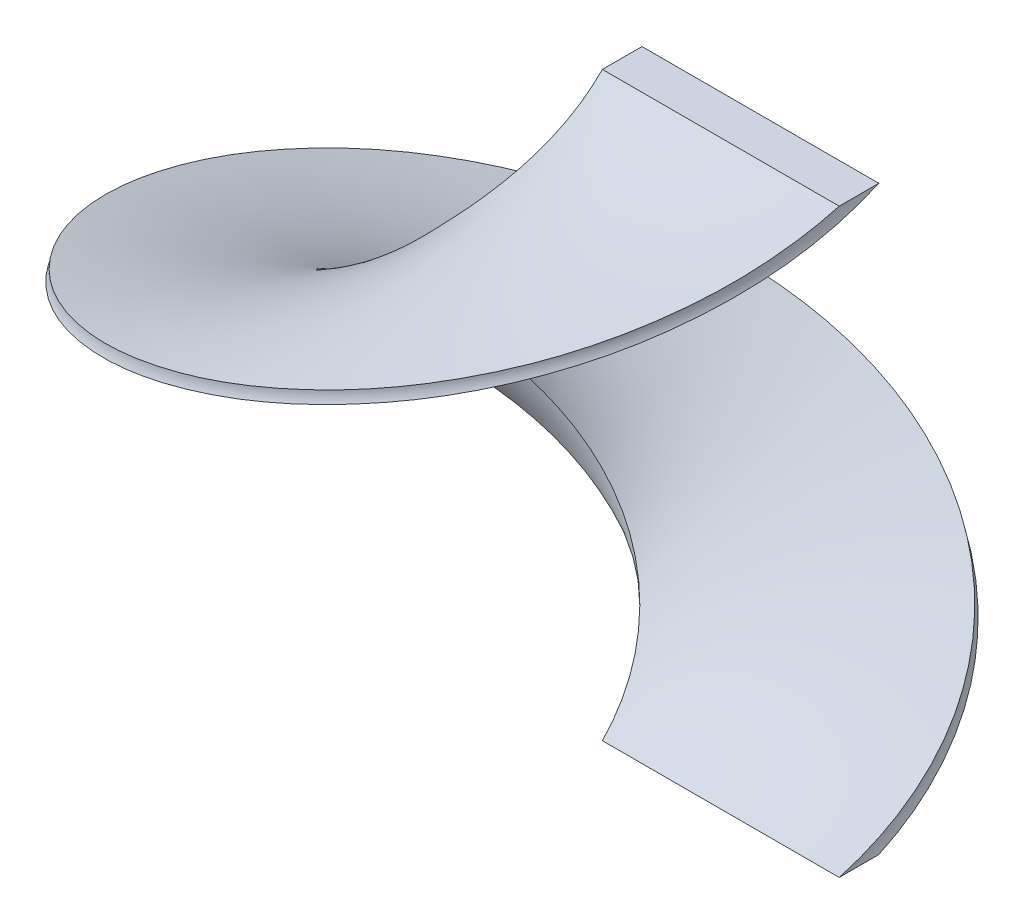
ISO-10303-21;
HEADER;
FILE_DESCRIPTION(('STEP AP214'),'2;1');
FILE_NAME('part.step','',(''),(''),'','','');
FILE_SCHEMA(('AUTOMOTIVE_DESIGN { 1 0 10303 214 1 1 1 1 }'));
ENDSEC;
DATA;
#1=APPLICATION_CONTEXT('core data for automotive mechanical design processes');
#2=APPLICATION_PROTOCOL_DEFINITION('international standard','automotive_design',2000,#1);
#3=PRODUCT_CONTEXT('',#1,'mechanical');
#4=PRODUCT('Part','Part','',(#3));
#5=PRODUCT_RELATED_PRODUCT_CATEGORY('part','',(#4));
#6=PRODUCT_DEFINITION_FORMATION('','',#4);
#7=PRODUCT_DEFINITION_CONTEXT('part definition',#1,'design');
#8=PRODUCT_DEFINITION('design','',#6,#7);
#9=PRODUCT_DEFINITION_SHAPE('','',#8);
#10=(LENGTH_UNIT() NAMED_UNIT(*) SI_UNIT(.MILLI.,.METRE.));
#11=(NAMED_UNIT(*) PLANE_ANGLE_UNIT() SI_UNIT($,.RADIAN.));
#12=(NAMED_UNIT(*) SI_UNIT($,.STERADIAN.) SOLID_ANGLE_UNIT());
#13=UNCERTAINTY_MEASURE_WITH_UNIT(LENGTH_MEASURE(1.E-05),#10,'distance_accuracy_value','');
#14=(GEOMETRIC_REPRESENTATION_CONTEXT(3) GLOBAL_UNCERTAINTY_ASSIGNED_CONTEXT((#13)) GLOBAL_UNIT_ASSIGNED_CONTEXT((#10,
#11,#12)) REPRESENTATION_CONTEXT('',''));
#15=CARTESIAN_POINT('',(0.,0.,0.));
#16=DIRECTION('',(0.,0.,1.));
#17=DIRECTION('',(1.,0.,0.));
#18=AXIS2_PLACEMENT_3D('',#15,#16,#17);
#19=CARTESIAN_POINT('',(0.,0.,0.));
#20=DIRECTION('',(0.,1.,0.));
#21=DIRECTION('',(0.,0.,1.));
#22=AXIS2_PLACEMENT_3D('',#19,#20,#21);
#23=PLANE('',#22);
#24=DIRECTION('',(0.,0.,1.));
#25=VECTOR('',#24,1.);
#26=CARTESIAN_POINT('',(13.335,0.,-5.842));
#27=LINE('',#26,#25);
#28=CARTESIAN_POINT('',(13.335,0.,-5.842));
#29=VERTEX_POINT('',#28);
#30=CARTESIAN_POINT('',(13.335,0.,0.));
#31=VERTEX_POINT('',#30);
#32=EDGE_CURVE('E74',#29,#31,#27,.T.);
#33=ORIENTED_EDGE('',*,*,#32,.F.);
#34=DIRECTION('',(-1.,0.,0.));
#35=VECTOR('',#34,1.);
#36=CARTESIAN_POINT('',(13.335,0.,-5.842));
#37=LINE('',#36,#35);
#38=CARTESIAN_POINT('',(48.26,0.,-5.842));
#39=VERTEX_POINT('',#38);
#40=EDGE_CURVE('E62',#39,#29,#37,.T.);
#41=ORIENTED_EDGE('',*,*,#40,.F.);
#42=DIRECTION('',(0.,0.,-1.));
#43=VECTOR('',#42,1.);
#44=CARTESIAN_POINT('',(48.26,0.,-5.842));
#45=LINE('',#44,#43);
#46=CARTESIAN_POINT('',(48.26,0.,0.));
#47=VERTEX_POINT('',#46);
#48=EDGE_CURVE('E67',#47,#39,#45,.T.);
#49=ORIENTED_EDGE('',*,*,#48,.F.);
#50=DIRECTION('',(1.,0.,0.));
#51=VECTOR('',#50,1.);
#52=CARTESIAN_POINT('',(13.335,0.,0.));
#53=LINE('',#52,#51);
#54=EDGE_CURVE('E71',#31,#47,#53,.T.);
#55=ORIENTED_EDGE('',*,*,#54,.F.);
#56=EDGE_LOOP('',(#33,#41,#49,#55));
#57=FACE_BOUND('',#56,.T.);
#58=ADVANCED_FACE('F32',(#57),#23,.F.);
#59=CARTESIAN_POINT('',(0.,85.725,0.));
#60=DIRECTION('',(0.,1.,0.));
#61=DIRECTION('',(0.,0.,1.));
#62=AXIS2_PLACEMENT_3D('',#59,#60,#61);
#63=PLANE('',#62);
#64=DIRECTION('',(0.,0.,1.));
#65=VECTOR('',#64,1.);
#66=CARTESIAN_POINT('',(13.3349999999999,85.725,-5.84200000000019));
#67=LINE('',#66,#65);
#68=CARTESIAN_POINT('',(13.335,85.7249999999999,-5.84200000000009));
#69=VERTEX_POINT('',#68);
#70=CARTESIAN_POINT('',(13.335,85.7249999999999,0.));
#71=VERTEX_POINT('',#70);
#72=EDGE_CURVE('E88',#69,#71,#67,.T.);
#73=ORIENTED_EDGE('',*,*,#72,.T.);
#74=DIRECTION('',(1.,0.,0.));
#75=VECTOR('',#74,1.);
#76=CARTESIAN_POINT('',(13.335,85.725,-1.86235614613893E-13));
#77=LINE('',#76,#75);
#78=CARTESIAN_POINT('',(48.26,85.7249999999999,-3.31087633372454E-13));
#79=VERTEX_POINT('',#78);
#80=EDGE_CURVE('E51',#71,#79,#77,.T.);
#81=ORIENTED_EDGE('',*,*,#80,.T.);
#82=DIRECTION('',(0.,0.,-1.));
#83=VECTOR('',#82,1.);
#84=CARTESIAN_POINT('',(48.2599999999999,85.725,-5.84200000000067));
#85=LINE('',#84,#83);
#86=CARTESIAN_POINT('',(48.26,85.7249999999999,-5.84200000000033));
#87=VERTEX_POINT('',#86);
#88=EDGE_CURVE('E45',#79,#87,#85,.T.);
#89=ORIENTED_EDGE('',*,*,#88,.T.);
#90=DIRECTION('',(-1.,0.,0.));
#91=VECTOR('',#90,1.);
#92=CARTESIAN_POINT('',(13.3349999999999,85.725,-5.84200000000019));
#93=LINE('',#92,#91);
#94=EDGE_CURVE('E11',#87,#69,#93,.T.);
#95=ORIENTED_EDGE('',*,*,#94,.T.);
#96=EDGE_LOOP('',(#73,#81,#89,#95));
#97=FACE_BOUND('',#96,.T.);
#98=ADVANCED_FACE('F133',(#97),#63,.T.);
#99=CARTESIAN_POINT('',(13.335,0.,-5.842));
#100=CARTESIAN_POINT('',(12.172953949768,2.67890624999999,-8.49449641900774));
#101=CARTESIAN_POINT('',(10.0842969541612,5.35781249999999,-10.5003877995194));
#102=CARTESIAN_POINT('',(7.99563995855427,8.03671874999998,-12.5062791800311));
#103=CARTESIAN_POINT('',(5.2983511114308,10.715625,-13.5601867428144));
#104=CARTESIAN_POINT('',(2.60106226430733,13.39453125,-14.6140943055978));
#105=CARTESIAN_POINT('',(-0.294220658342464,16.0734375,-14.5555701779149));
#106=CARTESIAN_POINT('',(-3.18950358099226,18.75234375,-14.497046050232));
#107=CARTESIAN_POINT('',(-5.842,21.4312499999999,-13.335));
#108=CARTESIAN_POINT('',(-8.49449641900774,24.1101562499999,-12.172953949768));
#109=CARTESIAN_POINT('',(-10.5003877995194,26.7890624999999,-10.0842969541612));
#110=CARTESIAN_POINT('',(-12.5062791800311,29.4679687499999,-7.99563995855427));
#111=CARTESIAN_POINT('',(-13.5601867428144,32.1468749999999,-5.2983511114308));
#112=CARTESIAN_POINT('',(-14.6140943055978,34.8257812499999,-2.60106226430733));
#113=CARTESIAN_POINT('',(-14.5555701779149,37.5046874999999,0.294220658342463));
#114=CARTESIAN_POINT('',(-14.497046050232,40.1835937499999,3.18950358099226));
#115=CARTESIAN_POINT('',(-13.335,42.8624999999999,5.842));
#116=CARTESIAN_POINT('',(-12.172953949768,45.5414062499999,8.49449641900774));
#117=CARTESIAN_POINT('',(-10.0842969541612,48.2203124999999,10.5003877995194));
#118=CARTESIAN_POINT('',(-7.99563995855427,50.8992187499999,12.5062791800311));
#119=CARTESIAN_POINT('',(-5.2983511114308,53.5781249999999,13.5601867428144));
#120=CARTESIAN_POINT('',(-2.60106226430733,56.2570312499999,14.6140943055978));
#121=CARTESIAN_POINT('',(0.294220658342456,58.9359374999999,14.5555701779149));
#122=CARTESIAN_POINT('',(3.18950358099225,61.6148437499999,14.497046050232));
#123=CARTESIAN_POINT('',(5.842,64.2937499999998,13.335));
#124=CARTESIAN_POINT('',(8.49449641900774,66.9726562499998,12.172953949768));
#125=CARTESIAN_POINT('',(10.5003877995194,69.6515624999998,10.0842969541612));
#126=CARTESIAN_POINT('',(12.5062791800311,72.3304687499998,7.99563995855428));
#127=CARTESIAN_POINT('',(13.5601867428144,75.0093749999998,5.2983511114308));
#128=CARTESIAN_POINT('',(14.6140943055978,77.6882812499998,2.60106226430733));
#129=CARTESIAN_POINT('',(14.5555701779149,80.3671874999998,-0.294220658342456));
#130=CARTESIAN_POINT('',(14.497046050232,83.0460937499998,-3.18950358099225));
#131=CARTESIAN_POINT('',(13.335,85.7249999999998,-5.842));
#132=CARTESIAN_POINT('',(13.335,0.,0.));
#133=CARTESIAN_POINT('',(13.335,2.67890624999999,-2.65249641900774));
#134=CARTESIAN_POINT('',(12.319933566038,5.35781249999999,-5.10308357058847));
#135=CARTESIAN_POINT('',(11.304867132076,8.03671874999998,-7.5536707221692));
#136=CARTESIAN_POINT('',(9.42926892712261,10.715625,-9.42926892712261));
#137=CARTESIAN_POINT('',(7.5536707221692,13.39453125,-11.304867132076));
#138=CARTESIAN_POINT('',(5.10308357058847,16.0734375,-12.319933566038));
#139=CARTESIAN_POINT('',(2.65249641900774,18.75234375,-13.335));
#140=CARTESIAN_POINT('',(0.,21.4312499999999,-13.335));
#141=CARTESIAN_POINT('',(-2.65249641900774,24.1101562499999,-13.335));
#142=CARTESIAN_POINT('',(-5.10308357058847,26.7890624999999,-12.319933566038));
#143=CARTESIAN_POINT('',(-7.5536707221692,29.4679687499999,-11.304867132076));
#144=CARTESIAN_POINT('',(-9.42926892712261,32.1468749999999,-9.42926892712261));
#145=CARTESIAN_POINT('',(-11.304867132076,34.8257812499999,-7.5536707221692));
#146=CARTESIAN_POINT('',(-12.319933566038,37.5046874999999,-5.10308357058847));
#147=CARTESIAN_POINT('',(-13.335,40.1835937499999,-2.65249641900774));
#148=CARTESIAN_POINT('',(-13.335,42.8624999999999,0.));
#149=CARTESIAN_POINT('',(-13.335,45.5414062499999,2.65249641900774));
#150=CARTESIAN_POINT('',(-12.319933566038,48.2203124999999,5.10308357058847));
#151=CARTESIAN_POINT('',(-11.304867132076,50.8992187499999,7.5536707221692));
#152=CARTESIAN_POINT('',(-9.42926892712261,53.5781249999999,9.42926892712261));
#153=CARTESIAN_POINT('',(-7.5536707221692,56.2570312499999,11.304867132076));
#154=CARTESIAN_POINT('',(-5.10308357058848,58.9359374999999,12.319933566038));
#155=CARTESIAN_POINT('',(-2.65249641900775,61.6148437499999,13.335));
#156=CARTESIAN_POINT('',(0.,64.2937499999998,13.335));
#157=CARTESIAN_POINT('',(2.65249641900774,66.9726562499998,13.335));
#158=CARTESIAN_POINT('',(5.10308357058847,69.6515624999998,12.319933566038));
#159=CARTESIAN_POINT('',(7.5536707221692,72.3304687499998,11.304867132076));
#160=CARTESIAN_POINT('',(9.42926892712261,75.0093749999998,9.42926892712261));
#161=CARTESIAN_POINT('',(11.304867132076,77.6882812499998,7.5536707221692));
#162=CARTESIAN_POINT('',(12.319933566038,80.3671874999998,5.10308357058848));
#163=CARTESIAN_POINT('',(13.335,83.0460937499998,2.65249641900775));
#164=CARTESIAN_POINT('',(13.335,85.7249999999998,0.));
#165=(BOUNDED_SURFACE() B_SPLINE_SURFACE(1,2,((#99,#100,#101,#102,#103,#104,#105,#106,#107,#108,
#109,#110,#111,#112,#113,#114,#115,#116,#117,#118,#119,#120,#121,#122,#123,#124,#125,#126,#127,
#128,#129,#130,#131),(#132,#133,#134,#135,#136,#137,#138,#139,#140,#141,#142,#143,#144,#145,
#146,#147,#148,#149,#150,#151,#152,#153,#154,#155,#156,#157,#158,#159,#160,#161,#162,#163,
#164)),.UNSPECIFIED.,.F.,.F.,.F.) B_SPLINE_SURFACE_WITH_KNOTS((2,2),(3,2,2,2,2,2,2,2,2,2,2,2,2,
2,2,2,3),(0.,1.),(0.,0.0625,0.125,0.1875,0.25,0.3125,0.375,0.4375,0.5,0.5625,0.625,0.6875,0.75,
0.8125,0.875,0.9375,1.),
.UNSPECIFIED.) GEOMETRIC_REPRESENTATION_ITEM() RATIONAL_B_SPLINE_SURFACE(((1.,0.98078528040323,
1.,0.98078528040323,1.,0.98078528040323,1.,0.98078528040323,1.,0.98078528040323,1.,
0.98078528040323,1.,0.98078528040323,1.,0.98078528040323,1.,0.98078528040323,1.,
0.98078528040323,1.,0.98078528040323,1.,0.98078528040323,1.,0.98078528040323,1.,
0.98078528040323,1.,0.98078528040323,1.,0.98078528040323,1.),(1.,0.98078528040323,1.,
0.98078528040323,1.,0.98078528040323,1.,0.98078528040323,1.,0.98078528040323,1.,
0.98078528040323,1.,0.98078528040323,1.,0.98078528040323,1.,0.98078528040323,1.,
0.98078528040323,1.,0.98078528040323,1.,0.98078528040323,1.,0.98078528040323,1.,
0.98078528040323,1.,0.98078528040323,1.,0.98078528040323,1.))) REPRESENTATION_ITEM('') SURFACE());
#166=CARTESIAN_POINT('',(13.335,0.,0.));
#167=CARTESIAN_POINT('',(13.335,2.67890624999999,-2.65249641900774));
#168=CARTESIAN_POINT('',(12.319933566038,5.35781249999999,-5.10308357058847));
#169=CARTESIAN_POINT('',(11.304867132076,8.03671874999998,-7.5536707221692));
#170=CARTESIAN_POINT('',(9.42926892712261,10.715625,-9.42926892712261));
#171=CARTESIAN_POINT('',(7.5536707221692,13.39453125,-11.304867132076));
#172=CARTESIAN_POINT('',(5.10308357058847,16.0734375,-12.319933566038));
#173=CARTESIAN_POINT('',(2.65249641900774,18.75234375,-13.335));
#174=CARTESIAN_POINT('',(0.,21.4312499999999,-13.335));
#175=CARTESIAN_POINT('',(-2.65249641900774,24.1101562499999,-13.335));
#176=CARTESIAN_POINT('',(-5.10308357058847,26.7890624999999,-12.319933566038));
#177=CARTESIAN_POINT('',(-7.5536707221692,29.4679687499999,-11.304867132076));
#178=CARTESIAN_POINT('',(-9.42926892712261,32.1468749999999,-9.42926892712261));
#179=CARTESIAN_POINT('',(-11.304867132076,34.8257812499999,-7.5536707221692));
#180=CARTESIAN_POINT('',(-12.319933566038,37.5046874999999,-5.10308357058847));
#181=CARTESIAN_POINT('',(-13.335,40.1835937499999,-2.65249641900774));
#182=CARTESIAN_POINT('',(-13.335,42.8624999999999,0.));
#183=CARTESIAN_POINT('',(-13.335,45.5414062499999,2.65249641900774));
#184=CARTESIAN_POINT('',(-12.319933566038,48.2203124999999,5.10308357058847));
#185=CARTESIAN_POINT('',(-11.304867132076,50.8992187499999,7.5536707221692));
#186=CARTESIAN_POINT('',(-9.42926892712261,53.5781249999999,9.42926892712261));
#187=CARTESIAN_POINT('',(-7.5536707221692,56.2570312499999,11.304867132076));
#188=CARTESIAN_POINT('',(-5.10308357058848,58.9359374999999,12.319933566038));
#189=CARTESIAN_POINT('',(-2.65249641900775,61.6148437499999,13.335));
#190=CARTESIAN_POINT('',(0.,64.2937499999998,13.335));
#191=CARTESIAN_POINT('',(2.65249641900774,66.9726562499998,13.335));
#192=CARTESIAN_POINT('',(5.10308357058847,69.6515624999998,12.319933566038));
#193=CARTESIAN_POINT('',(7.5536707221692,72.3304687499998,11.304867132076));
#194=CARTESIAN_POINT('',(9.42926892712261,75.0093749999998,9.42926892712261));
#195=CARTESIAN_POINT('',(11.304867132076,77.6882812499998,7.5536707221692));
#196=CARTESIAN_POINT('',(12.319933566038,80.3671874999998,5.10308357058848));
#197=CARTESIAN_POINT('',(13.335,83.0460937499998,2.65249641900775));
#198=CARTESIAN_POINT('',(13.335,85.7249999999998,0.));
#199=(BOUNDED_CURVE() B_SPLINE_CURVE(2,(#166,#167,#168,#169,#170,#171,#172,#173,#174,#175,#176,
#177,#178,#179,#180,#181,#182,#183,#184,#185,#186,#187,#188,#189,#190,#191,#192,#193,#194,#195,
#196,#197,#198),.UNSPECIFIED.,.F.,.F.) B_SPLINE_CURVE_WITH_KNOTS((3,2,2,2,2,2,2,2,2,2,2,2,2,2,2,
2,3),(0.,0.0625,0.125,0.1875,0.25,0.3125,0.375,0.4375,0.5,0.5625,0.625,0.6875,0.75,0.8125,0.875,
0.9375,1.),.UNSPECIFIED.) CURVE() GEOMETRIC_REPRESENTATION_ITEM() RATIONAL_B_SPLINE_CURVE((1.,
0.98078528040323,1.,0.98078528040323,1.,0.98078528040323,1.,0.98078528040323,1.,
0.98078528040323,1.,0.98078528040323,1.,0.98078528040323,1.,0.98078528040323,1.,
0.98078528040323,1.,0.98078528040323,1.,0.98078528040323,1.,0.98078528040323,1.,
0.98078528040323,1.,0.98078528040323,1.,0.98078528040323,1.,0.98078528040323,1.)) REPRESENTATION_ITEM(''));
#200=EDGE_CURVE('E90',#31,#71,#199,.T.);
#201=CARTESIAN_POINT('',(13.335,0.,-5.842));
#202=CARTESIAN_POINT('',(12.172953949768,2.67890624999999,-8.49449641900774));
#203=CARTESIAN_POINT('',(10.0842969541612,5.35781249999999,-10.5003877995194));
#204=CARTESIAN_POINT('',(7.99563995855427,8.03671874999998,-12.5062791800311));
#205=CARTESIAN_POINT('',(5.2983511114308,10.715625,-13.5601867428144));
#206=CARTESIAN_POINT('',(2.60106226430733,13.39453125,-14.6140943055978));
#207=CARTESIAN_POINT('',(-0.294220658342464,16.0734375,-14.5555701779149));
#208=CARTESIAN_POINT('',(-3.18950358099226,18.75234375,-14.497046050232));
#209=CARTESIAN_POINT('',(-5.842,21.4312499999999,-13.335));
#210=CARTESIAN_POINT('',(-8.49449641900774,24.1101562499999,-12.172953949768));
#211=CARTESIAN_POINT('',(-10.5003877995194,26.7890624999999,-10.0842969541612));
#212=CARTESIAN_POINT('',(-12.5062791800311,29.4679687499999,-7.99563995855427));
#213=CARTESIAN_POINT('',(-13.5601867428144,32.1468749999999,-5.2983511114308));
#214=CARTESIAN_POINT('',(-14.6140943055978,34.8257812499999,-2.60106226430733));
#215=CARTESIAN_POINT('',(-14.5555701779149,37.5046874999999,0.294220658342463));
#216=CARTESIAN_POINT('',(-14.497046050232,40.1835937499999,3.18950358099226));
#217=CARTESIAN_POINT('',(-13.335,42.8624999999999,5.842));
#218=CARTESIAN_POINT('',(-12.172953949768,45.5414062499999,8.49449641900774));
#219=CARTESIAN_POINT('',(-10.0842969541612,48.2203124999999,10.5003877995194));
#220=CARTESIAN_POINT('',(-7.99563995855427,50.8992187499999,12.5062791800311));
#221=CARTESIAN_POINT('',(-5.2983511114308,53.5781249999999,13.5601867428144));
#222=CARTESIAN_POINT('',(-2.60106226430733,56.2570312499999,14.6140943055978));
#223=CARTESIAN_POINT('',(0.294220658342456,58.9359374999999,14.5555701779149));
#224=CARTESIAN_POINT('',(3.18950358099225,61.6148437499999,14.497046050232));
#225=CARTESIAN_POINT('',(5.842,64.2937499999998,13.335));
#226=CARTESIAN_POINT('',(8.49449641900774,66.9726562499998,12.172953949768));
#227=CARTESIAN_POINT('',(10.5003877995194,69.6515624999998,10.0842969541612));
#228=CARTESIAN_POINT('',(12.5062791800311,72.3304687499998,7.99563995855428));
#229=CARTESIAN_POINT('',(13.5601867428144,75.0093749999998,5.2983511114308));
#230=CARTESIAN_POINT('',(14.6140943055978,77.6882812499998,2.60106226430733));
#231=CARTESIAN_POINT('',(14.5555701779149,80.3671874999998,-0.294220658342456));
#232=CARTESIAN_POINT('',(14.497046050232,83.0460937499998,-3.18950358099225));
#233=CARTESIAN_POINT('',(13.335,85.7249999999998,-5.842));
#234=(BOUNDED_CURVE() B_SPLINE_CURVE(2,(#201,#202,#203,#204,#205,#206,#207,#208,#209,#210,#211,
#212,#213,#214,#215,#216,#217,#218,#219,#220,#221,#222,#223,#224,#225,#226,#227,#228,#229,#230,
#231,#232,#233),.UNSPECIFIED.,.F.,.F.) B_SPLINE_CURVE_WITH_KNOTS((3,2,2,2,2,2,2,2,2,2,2,2,2,2,2,
2,3),(0.,0.0625,0.125,0.1875,0.25,0.3125,0.375,0.4375,0.5,0.5625,0.625,0.6875,0.75,0.8125,0.875,
0.9375,1.),.UNSPECIFIED.) CURVE() GEOMETRIC_REPRESENTATION_ITEM() RATIONAL_B_SPLINE_CURVE((1.,
0.98078528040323,1.,0.98078528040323,1.,0.98078528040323,1.,0.98078528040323,1.,
0.98078528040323,1.,0.98078528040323,1.,0.98078528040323,1.,0.98078528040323,1.,
0.98078528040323,1.,0.98078528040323,1.,0.98078528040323,1.,0.98078528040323,1.,
0.98078528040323,1.,0.98078528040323,1.,0.98078528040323,1.,0.98078528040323,1.)) REPRESENTATION_ITEM(''));
#235=EDGE_CURVE('E84',#29,#69,#234,.T.);
#236=ORIENTED_EDGE('',*,*,#200,.T.);
#237=ORIENTED_EDGE('',*,*,#72,.F.);
#238=ORIENTED_EDGE('',*,*,#235,.F.);
#239=ORIENTED_EDGE('',*,*,#32,.T.);
#240=EDGE_LOOP('',(#236,#237,#238,#239));
#241=FACE_BOUND('',#240,.T.);
#242=ADVANCED_FACE('F87',(#241),#165,.T.);
#243=CARTESIAN_POINT('',(13.335,0.,0.));
#244=CARTESIAN_POINT('',(13.335,2.67890624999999,-2.65249641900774));
#245=CARTESIAN_POINT('',(12.319933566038,5.35781249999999,-5.10308357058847));
#246=CARTESIAN_POINT('',(11.304867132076,8.03671874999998,-7.5536707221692));
#247=CARTESIAN_POINT('',(9.42926892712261,10.715625,-9.42926892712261));
#248=CARTESIAN_POINT('',(7.5536707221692,13.39453125,-11.304867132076));
#249=CARTESIAN_POINT('',(5.10308357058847,16.0734375,-12.319933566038));
#250=CARTESIAN_POINT('',(2.65249641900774,18.75234375,-13.335));
#251=CARTESIAN_POINT('',(0.,21.4312499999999,-13.335));
#252=CARTESIAN_POINT('',(-2.65249641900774,24.1101562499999,-13.335));
#253=CARTESIAN_POINT('',(-5.10308357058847,26.7890624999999,-12.319933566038));
#254=CARTESIAN_POINT('',(-7.5536707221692,29.4679687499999,-11.304867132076));
#255=CARTESIAN_POINT('',(-9.42926892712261,32.1468749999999,-9.42926892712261));
#256=CARTESIAN_POINT('',(-11.304867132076,34.8257812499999,-7.5536707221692));
#257=CARTESIAN_POINT('',(-12.319933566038,37.5046874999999,-5.10308357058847));
#258=CARTESIAN_POINT('',(-13.335,40.1835937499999,-2.65249641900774));
#259=CARTESIAN_POINT('',(-13.335,42.8624999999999,0.));
#260=CARTESIAN_POINT('',(-13.335,45.5414062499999,2.65249641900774));
#261=CARTESIAN_POINT('',(-12.319933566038,48.2203124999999,5.10308357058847));
#262=CARTESIAN_POINT('',(-11.304867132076,50.8992187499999,7.5536707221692));
#263=CARTESIAN_POINT('',(-9.42926892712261,53.5781249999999,9.42926892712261));
#264=CARTESIAN_POINT('',(-7.5536707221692,56.2570312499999,11.304867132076));
#265=CARTESIAN_POINT('',(-5.10308357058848,58.9359374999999,12.319933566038));
#266=CARTESIAN_POINT('',(-2.65249641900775,61.6148437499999,13.335));
#267=CARTESIAN_POINT('',(0.,64.2937499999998,13.335));
#268=CARTESIAN_POINT('',(2.65249641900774,66.9726562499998,13.335));
#269=CARTESIAN_POINT('',(5.10308357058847,69.6515624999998,12.319933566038));
#270=CARTESIAN_POINT('',(7.5536707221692,72.3304687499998,11.304867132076));
#271=CARTESIAN_POINT('',(9.42926892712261,75.0093749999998,9.42926892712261));
#272=CARTESIAN_POINT('',(11.304867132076,77.6882812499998,7.5536707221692));
#273=CARTESIAN_POINT('',(12.319933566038,80.3671874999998,5.10308357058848));
#274=CARTESIAN_POINT('',(13.335,83.0460937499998,2.65249641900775));
#275=CARTESIAN_POINT('',(13.335,85.7249999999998,0.));
#276=CARTESIAN_POINT('',(48.26,0.,0.));
#277=CARTESIAN_POINT('',(48.26,2.67890624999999,-9.59951084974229));
#278=CARTESIAN_POINT('',(44.5864262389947,5.35781249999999,-18.4683024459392));
#279=CARTESIAN_POINT('',(40.9128524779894,8.03671874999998,-27.3370940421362));
#280=CARTESIAN_POINT('',(34.1249732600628,10.715625,-34.1249732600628));
#281=CARTESIAN_POINT('',(27.3370940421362,13.39453125,-40.9128524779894));
#282=CARTESIAN_POINT('',(18.4683024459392,16.0734375,-44.5864262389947));
#283=CARTESIAN_POINT('',(9.5995108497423,18.75234375,-48.26));
#284=CARTESIAN_POINT('',(0.,21.4312499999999,-48.26));
#285=CARTESIAN_POINT('',(-9.59951084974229,24.1101562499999,-48.26));
#286=CARTESIAN_POINT('',(-18.4683024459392,26.7890624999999,-44.5864262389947));
#287=CARTESIAN_POINT('',(-27.3370940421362,29.4679687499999,-40.9128524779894));
#288=CARTESIAN_POINT('',(-34.1249732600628,32.1468749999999,-34.1249732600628));
#289=CARTESIAN_POINT('',(-40.9128524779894,34.8257812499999,-27.3370940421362));
#290=CARTESIAN_POINT('',(-44.5864262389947,37.5046874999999,-18.4683024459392));
#291=CARTESIAN_POINT('',(-48.26,40.1835937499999,-9.59951084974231));
#292=CARTESIAN_POINT('',(-48.26,42.8624999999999,0.));
#293=CARTESIAN_POINT('',(-48.26,45.5414062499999,9.5995108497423));
#294=CARTESIAN_POINT('',(-44.5864262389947,48.2203124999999,18.4683024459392));
#295=CARTESIAN_POINT('',(-40.9128524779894,50.8992187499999,27.3370940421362));
#296=CARTESIAN_POINT('',(-34.1249732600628,53.5781249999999,34.1249732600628));
#297=CARTESIAN_POINT('',(-27.3370940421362,56.2570312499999,40.9128524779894));
#298=CARTESIAN_POINT('',(-18.4683024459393,58.9359374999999,44.5864262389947));
#299=CARTESIAN_POINT('',(-9.59951084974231,61.6148437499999,48.26));
#300=CARTESIAN_POINT('',(0.,64.2937499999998,48.26));
#301=CARTESIAN_POINT('',(9.5995108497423,66.9726562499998,48.26));
#302=CARTESIAN_POINT('',(18.4683024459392,69.6515624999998,44.5864262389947));
#303=CARTESIAN_POINT('',(27.3370940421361,72.3304687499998,40.9128524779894));
#304=CARTESIAN_POINT('',(34.1249732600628,75.0093749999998,34.1249732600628));
#305=CARTESIAN_POINT('',(40.9128524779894,77.6882812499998,27.3370940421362));
#306=CARTESIAN_POINT('',(44.5864262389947,80.3671874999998,18.4683024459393));
#307=CARTESIAN_POINT('',(48.26,83.0460937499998,9.59951084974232));
#308=CARTESIAN_POINT('',(48.26,85.7249999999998,0.));
#309=(BOUNDED_SURFACE() B_SPLINE_SURFACE(1,2,((#243,#244,#245,#246,#247,#248,#249,#250,#251,
#252,#253,#254,#255,#256,#257,#258,#259,#260,#261,#262,#263,#264,#265,#266,#267,#268,#269,#270,
#271,#272,#273,#274,#275),(#276,#277,#278,#279,#280,#281,#282,#283,#284,#285,#286,#287,#288,
#289,#290,#291,#292,#293,#294,#295,#296,#297,#298,#299,#300,#301,#302,#303,#304,#305,#306,#307,
#308)),.UNSPECIFIED.,.F.,.F.,.F.) B_SPLINE_SURFACE_WITH_KNOTS((2,2),(3,2,2,2,2,2,2,2,2,2,2,2,2,
2,2,2,3),(0.,1.),(0.,0.0625,0.125,0.1875,0.25,0.3125,0.375,0.4375,0.5,0.5625,0.625,0.6875,0.75,
0.8125,0.875,0.9375,1.),
.UNSPECIFIED.) GEOMETRIC_REPRESENTATION_ITEM() RATIONAL_B_SPLINE_SURFACE(((1.,0.98078528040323,
1.,0.98078528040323,1.,0.98078528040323,1.,0.98078528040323,1.,0.98078528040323,1.,
0.98078528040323,1.,0.98078528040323,1.,0.98078528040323,1.,0.98078528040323,1.,
0.98078528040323,1.,0.98078528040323,1.,0.98078528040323,1.,0.98078528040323,1.,
0.98078528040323,1.,0.98078528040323,1.,0.98078528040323,1.),(1.,0.98078528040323,1.,
0.98078528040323,1.,0.98078528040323,1.,0.98078528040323,1.,0.98078528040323,1.,
0.98078528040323,1.,0.98078528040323,1.,0.98078528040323,1.,0.98078528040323,1.,
0.98078528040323,1.,0.98078528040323,1.,0.98078528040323,1.,0.98078528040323,1.,
0.98078528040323,1.,0.98078528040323,1.,0.98078528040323,1.))) REPRESENTATION_ITEM('') SURFACE());
#310=CARTESIAN_POINT('',(48.26,0.,0.));
#311=CARTESIAN_POINT('',(48.26,2.67890624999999,-9.59951084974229));
#312=CARTESIAN_POINT('',(44.5864262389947,5.35781249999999,-18.4683024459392));
#313=CARTESIAN_POINT('',(40.9128524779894,8.03671874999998,-27.3370940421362));
#314=CARTESIAN_POINT('',(34.1249732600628,10.715625,-34.1249732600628));
#315=CARTESIAN_POINT('',(27.3370940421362,13.39453125,-40.9128524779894));
#316=CARTESIAN_POINT('',(18.4683024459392,16.0734375,-44.5864262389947));
#317=CARTESIAN_POINT('',(9.5995108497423,18.75234375,-48.26));
#318=CARTESIAN_POINT('',(0.,21.4312499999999,-48.26));
#319=CARTESIAN_POINT('',(-9.59951084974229,24.1101562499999,-48.26));
#320=CARTESIAN_POINT('',(-18.4683024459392,26.7890624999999,-44.5864262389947));
#321=CARTESIAN_POINT('',(-27.3370940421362,29.4679687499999,-40.9128524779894));
#322=CARTESIAN_POINT('',(-34.1249732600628,32.1468749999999,-34.1249732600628));
#323=CARTESIAN_POINT('',(-40.9128524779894,34.8257812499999,-27.3370940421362));
#324=CARTESIAN_POINT('',(-44.5864262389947,37.5046874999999,-18.4683024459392));
#325=CARTESIAN_POINT('',(-48.26,40.1835937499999,-9.59951084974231));
#326=CARTESIAN_POINT('',(-48.26,42.8624999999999,0.));
#327=CARTESIAN_POINT('',(-48.26,45.5414062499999,9.5995108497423));
#328=CARTESIAN_POINT('',(-44.5864262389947,48.2203124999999,18.4683024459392));
#329=CARTESIAN_POINT('',(-40.9128524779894,50.8992187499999,27.3370940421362));
#330=CARTESIAN_POINT('',(-34.1249732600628,53.5781249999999,34.1249732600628));
#331=CARTESIAN_POINT('',(-27.3370940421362,56.2570312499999,40.9128524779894));
#332=CARTESIAN_POINT('',(-18.4683024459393,58.9359374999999,44.5864262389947));
#333=CARTESIAN_POINT('',(-9.59951084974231,61.6148437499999,48.26));
#334=CARTESIAN_POINT('',(0.,64.2937499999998,48.26));
#335=CARTESIAN_POINT('',(9.5995108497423,66.9726562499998,48.26));
#336=CARTESIAN_POINT('',(18.4683024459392,69.6515624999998,44.5864262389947));
#337=CARTESIAN_POINT('',(27.3370940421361,72.3304687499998,40.9128524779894));
#338=CARTESIAN_POINT('',(34.1249732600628,75.0093749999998,34.1249732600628));
#339=CARTESIAN_POINT('',(40.9128524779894,77.6882812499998,27.3370940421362));
#340=CARTESIAN_POINT('',(44.5864262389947,80.3671874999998,18.4683024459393));
#341=CARTESIAN_POINT('',(48.26,83.0460937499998,9.59951084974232));
#342=CARTESIAN_POINT('',(48.26,85.7249999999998,0.));
#343=(BOUNDED_CURVE() B_SPLINE_CURVE(2,(#310,#311,#312,#313,#314,#315,#316,#317,#318,#319,#320,
#321,#322,#323,#324,#325,#326,#327,#328,#329,#330,#331,#332,#333,#334,#335,#336,#337,#338,#339,
#340,#341,#342),.UNSPECIFIED.,.F.,.F.) B_SPLINE_CURVE_WITH_KNOTS((3,2,2,2,2,2,2,2,2,2,2,2,2,2,2,
2,3),(0.,0.0625,0.125,0.1875,0.25,0.3125,0.375,0.4375,0.5,0.5625,0.625,0.6875,0.75,0.8125,0.875,
0.9375,1.),.UNSPECIFIED.) CURVE() GEOMETRIC_REPRESENTATION_ITEM() RATIONAL_B_SPLINE_CURVE((1.,
0.98078528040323,1.,0.98078528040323,1.,0.98078528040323,1.,0.98078528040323,1.,
0.98078528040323,1.,0.98078528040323,1.,0.98078528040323,1.,0.98078528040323,1.,
0.98078528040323,1.,0.98078528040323,1.,0.98078528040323,1.,0.98078528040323,1.,
0.98078528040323,1.,0.98078528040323,1.,0.98078528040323,1.,0.98078528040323,1.)) REPRESENTATION_ITEM(''));
#344=EDGE_CURVE('E104',#47,#79,#343,.T.);
#345=ORIENTED_EDGE('',*,*,#344,.T.);
#346=ORIENTED_EDGE('',*,*,#80,.F.);
#347=ORIENTED_EDGE('',*,*,#200,.F.);
#348=ORIENTED_EDGE('',*,*,#54,.T.);
#349=EDGE_LOOP('',(#345,#346,#347,#348));
#350=FACE_BOUND('',#349,.T.);
#351=ADVANCED_FACE('F125',(#350),#309,.T.);
#352=CARTESIAN_POINT('',(48.26,0.,0.));
#353=CARTESIAN_POINT('',(48.26,2.67890624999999,-9.59951084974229));
#354=CARTESIAN_POINT('',(44.5864262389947,5.35781249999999,-18.4683024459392));
#355=CARTESIAN_POINT('',(40.9128524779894,8.03671874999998,-27.3370940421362));
#356=CARTESIAN_POINT('',(34.1249732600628,10.715625,-34.1249732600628));
#357=CARTESIAN_POINT('',(27.3370940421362,13.39453125,-40.9128524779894));
#358=CARTESIAN_POINT('',(18.4683024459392,16.0734375,-44.5864262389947));
#359=CARTESIAN_POINT('',(9.5995108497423,18.75234375,-48.26));
#360=CARTESIAN_POINT('',(0.,21.4312499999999,-48.26));
#361=CARTESIAN_POINT('',(-9.59951084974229,24.1101562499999,-48.26));
#362=CARTESIAN_POINT('',(-18.4683024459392,26.7890624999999,-44.5864262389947));
#363=CARTESIAN_POINT('',(-27.3370940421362,29.4679687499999,-40.9128524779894));
#364=CARTESIAN_POINT('',(-34.1249732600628,32.1468749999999,-34.1249732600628));
#365=CARTESIAN_POINT('',(-40.9128524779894,34.8257812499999,-27.3370940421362));
#366=CARTESIAN_POINT('',(-44.5864262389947,37.5046874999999,-18.4683024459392));
#367=CARTESIAN_POINT('',(-48.26,40.1835937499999,-9.59951084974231));
#368=CARTESIAN_POINT('',(-48.26,42.8624999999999,0.));
#369=CARTESIAN_POINT('',(-48.26,45.5414062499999,9.5995108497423));
#370=CARTESIAN_POINT('',(-44.5864262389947,48.2203124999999,18.4683024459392));
#371=CARTESIAN_POINT('',(-40.9128524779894,50.8992187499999,27.3370940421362));
#372=CARTESIAN_POINT('',(-34.1249732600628,53.5781249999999,34.1249732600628));
#373=CARTESIAN_POINT('',(-27.3370940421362,56.2570312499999,40.9128524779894));
#374=CARTESIAN_POINT('',(-18.4683024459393,58.9359374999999,44.5864262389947));
#375=CARTESIAN_POINT('',(-9.59951084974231,61.6148437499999,48.26));
#376=CARTESIAN_POINT('',(0.,64.2937499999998,48.26));
#377=CARTESIAN_POINT('',(9.5995108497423,66.9726562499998,48.26));
#378=CARTESIAN_POINT('',(18.4683024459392,69.6515624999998,44.5864262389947));
#379=CARTESIAN_POINT('',(27.3370940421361,72.3304687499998,40.9128524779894));
#380=CARTESIAN_POINT('',(34.1249732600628,75.0093749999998,34.1249732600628));
#381=CARTESIAN_POINT('',(40.9128524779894,77.6882812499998,27.3370940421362));
#382=CARTESIAN_POINT('',(44.5864262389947,80.3671874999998,18.4683024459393));
#383=CARTESIAN_POINT('',(48.26,83.0460937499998,9.59951084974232));
#384=CARTESIAN_POINT('',(48.26,85.7249999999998,0.));
#385=CARTESIAN_POINT('',(48.26,0.,-5.842));
#386=CARTESIAN_POINT('',(47.097953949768,2.67890624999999,-15.4415108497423));
#387=CARTESIAN_POINT('',(42.3507896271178,5.35781249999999,-23.8656066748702));
#388=CARTESIAN_POINT('',(37.6036253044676,8.03671874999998,-32.289702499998));
#389=CARTESIAN_POINT('',(29.994055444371,10.715625,-38.2558910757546));
#390=CARTESIAN_POINT('',(22.3844855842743,13.39453125,-44.2220796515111));
#391=CARTESIAN_POINT('',(13.0709982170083,16.0734375,-46.8220628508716));
#392=CARTESIAN_POINT('',(3.7575108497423,18.75234375,-49.422046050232));
#393=CARTESIAN_POINT('',(-5.842,21.4312499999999,-48.26));
#394=CARTESIAN_POINT('',(-15.4415108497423,24.1101562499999,-47.097953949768));
#395=CARTESIAN_POINT('',(-23.8656066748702,26.7890624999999,-42.3507896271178));
#396=CARTESIAN_POINT('',(-32.289702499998,29.4679687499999,-37.6036253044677));
#397=CARTESIAN_POINT('',(-38.2558910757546,32.1468749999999,-29.994055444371));
#398=CARTESIAN_POINT('',(-44.2220796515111,34.8257812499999,-22.3844855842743));
#399=CARTESIAN_POINT('',(-46.8220628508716,37.5046874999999,-13.0709982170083));
#400=CARTESIAN_POINT('',(-49.422046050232,40.1835937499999,-3.75751084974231));
#401=CARTESIAN_POINT('',(-48.26,42.8624999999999,5.84199999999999));
#402=CARTESIAN_POINT('',(-47.097953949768,45.5414062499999,15.4415108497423));
#403=CARTESIAN_POINT('',(-42.3507896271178,48.2203124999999,23.8656066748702));
#404=CARTESIAN_POINT('',(-37.6036253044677,50.8992187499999,32.289702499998));
#405=CARTESIAN_POINT('',(-29.994055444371,53.5781249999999,38.2558910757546));
#406=CARTESIAN_POINT('',(-22.3844855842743,56.2570312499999,44.2220796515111));
#407=CARTESIAN_POINT('',(-13.0709982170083,58.9359374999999,46.8220628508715));
#408=CARTESIAN_POINT('',(-3.75751084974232,61.6148437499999,49.422046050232));
#409=CARTESIAN_POINT('',(5.84199999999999,64.2937499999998,48.26));
#410=CARTESIAN_POINT('',(15.4415108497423,66.9726562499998,47.097953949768));
#411=CARTESIAN_POINT('',(23.8656066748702,69.6515624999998,42.3507896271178));
#412=CARTESIAN_POINT('',(32.289702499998,72.3304687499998,37.6036253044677));
#413=CARTESIAN_POINT('',(38.2558910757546,75.0093749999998,29.994055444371));
#414=CARTESIAN_POINT('',(44.2220796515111,77.6882812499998,22.3844855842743));
#415=CARTESIAN_POINT('',(46.8220628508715,80.3671874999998,13.0709982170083));
#416=CARTESIAN_POINT('',(49.422046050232,83.0460937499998,3.75751084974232));
#417=CARTESIAN_POINT('',(48.26,85.7249999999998,-5.842));
#418=(BOUNDED_SURFACE() B_SPLINE_SURFACE(1,2,((#352,#353,#354,#355,#356,#357,#358,#359,#360,
#361,#362,#363,#364,#365,#366,#367,#368,#369,#370,#371,#372,#373,#374,#375,#376,#377,#378,#379,
#380,#381,#382,#383,#384),(#385,#386,#387,#388,#389,#390,#391,#392,#393,#394,#395,#396,#397,
#398,#399,#400,#401,#402,#403,#404,#405,#406,#407,#408,#409,#410,#411,#412,#413,#414,#415,#416,
#417)),.UNSPECIFIED.,.F.,.F.,.F.) B_SPLINE_SURFACE_WITH_KNOTS((2,2),(3,2,2,2,2,2,2,2,2,2,2,2,2,
2,2,2,3),(0.,1.),(0.,0.0625,0.125,0.1875,0.25,0.3125,0.375,0.4375,0.5,0.5625,0.625,0.6875,0.75,
0.8125,0.875,0.9375,1.),
.UNSPECIFIED.) GEOMETRIC_REPRESENTATION_ITEM() RATIONAL_B_SPLINE_SURFACE(((1.,0.98078528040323,
1.,0.98078528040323,1.,0.98078528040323,1.,0.98078528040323,1.,0.98078528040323,1.,
0.98078528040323,1.,0.98078528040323,1.,0.98078528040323,1.,0.98078528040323,1.,
0.98078528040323,1.,0.98078528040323,1.,0.98078528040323,1.,0.98078528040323,1.,
0.98078528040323,1.,0.98078528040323,1.,0.98078528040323,1.),(1.,0.98078528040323,1.,
0.98078528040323,1.,0.98078528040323,1.,0.98078528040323,1.,0.98078528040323,1.,
0.98078528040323,1.,0.98078528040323,1.,0.98078528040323,1.,0.98078528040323,1.,
0.98078528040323,1.,0.98078528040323,1.,0.98078528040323,1.,0.98078528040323,1.,
0.98078528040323,1.,0.98078528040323,1.,0.98078528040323,1.))) REPRESENTATION_ITEM('') SURFACE());
#419=CARTESIAN_POINT('',(48.26,0.,-5.842));
#420=CARTESIAN_POINT('',(47.097953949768,2.67890624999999,-15.4415108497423));
#421=CARTESIAN_POINT('',(42.3507896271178,5.35781249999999,-23.8656066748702));
#422=CARTESIAN_POINT('',(37.6036253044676,8.03671874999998,-32.289702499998));
#423=CARTESIAN_POINT('',(29.994055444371,10.715625,-38.2558910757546));
#424=CARTESIAN_POINT('',(22.3844855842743,13.39453125,-44.2220796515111));
#425=CARTESIAN_POINT('',(13.0709982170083,16.0734375,-46.8220628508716));
#426=CARTESIAN_POINT('',(3.7575108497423,18.75234375,-49.422046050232));
#427=CARTESIAN_POINT('',(-5.842,21.4312499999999,-48.26));
#428=CARTESIAN_POINT('',(-15.4415108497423,24.1101562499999,-47.097953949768));
#429=CARTESIAN_POINT('',(-23.8656066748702,26.7890624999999,-42.3507896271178));
#430=CARTESIAN_POINT('',(-32.289702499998,29.4679687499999,-37.6036253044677));
#431=CARTESIAN_POINT('',(-38.2558910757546,32.1468749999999,-29.994055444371));
#432=CARTESIAN_POINT('',(-44.2220796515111,34.8257812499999,-22.3844855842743));
#433=CARTESIAN_POINT('',(-46.8220628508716,37.5046874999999,-13.0709982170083));
#434=CARTESIAN_POINT('',(-49.422046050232,40.1835937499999,-3.75751084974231));
#435=CARTESIAN_POINT('',(-48.26,42.8624999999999,5.84199999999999));
#436=CARTESIAN_POINT('',(-47.097953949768,45.5414062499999,15.4415108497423));
#437=CARTESIAN_POINT('',(-42.3507896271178,48.2203124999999,23.8656066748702));
#438=CARTESIAN_POINT('',(-37.6036253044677,50.8992187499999,32.289702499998));
#439=CARTESIAN_POINT('',(-29.994055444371,53.5781249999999,38.2558910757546));
#440=CARTESIAN_POINT('',(-22.3844855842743,56.2570312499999,44.2220796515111));
#441=CARTESIAN_POINT('',(-13.0709982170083,58.9359374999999,46.8220628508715));
#442=CARTESIAN_POINT('',(-3.75751084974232,61.6148437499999,49.422046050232));
#443=CARTESIAN_POINT('',(5.84199999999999,64.2937499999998,48.26));
#444=CARTESIAN_POINT('',(15.4415108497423,66.9726562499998,47.097953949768));
#445=CARTESIAN_POINT('',(23.8656066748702,69.6515624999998,42.3507896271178));
#446=CARTESIAN_POINT('',(32.289702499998,72.3304687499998,37.6036253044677));
#447=CARTESIAN_POINT('',(38.2558910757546,75.0093749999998,29.994055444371));
#448=CARTESIAN_POINT('',(44.2220796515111,77.6882812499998,22.3844855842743));
#449=CARTESIAN_POINT('',(46.8220628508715,80.3671874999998,13.0709982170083));
#450=CARTESIAN_POINT('',(49.422046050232,83.0460937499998,3.75751084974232));
#451=CARTESIAN_POINT('',(48.26,85.7249999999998,-5.84199999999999));
#452=(BOUNDED_CURVE() B_SPLINE_CURVE(2,(#419,#420,#421,#422,#423,#424,#425,#426,#427,#428,#429,
#430,#431,#432,#433,#434,#435,#436,#437,#438,#439,#440,#441,#442,#443,#444,#445,#446,#447,#448,
#449,#450,#451),.UNSPECIFIED.,.F.,.F.) B_SPLINE_CURVE_WITH_KNOTS((3,2,2,2,2,2,2,2,2,2,2,2,2,2,2,
2,3),(0.,0.0625,0.125,0.1875,0.25,0.3125,0.375,0.4375,0.5,0.5625,0.625,0.6875,0.75,0.8125,0.875,
0.9375,1.),.UNSPECIFIED.) CURVE() GEOMETRIC_REPRESENTATION_ITEM() RATIONAL_B_SPLINE_CURVE((1.,
0.98078528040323,1.,0.98078528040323,1.,0.98078528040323,1.,0.98078528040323,1.,
0.98078528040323,1.,0.98078528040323,1.,0.98078528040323,1.,0.98078528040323,1.,
0.98078528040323,1.,0.98078528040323,1.,0.98078528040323,1.,0.98078528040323,1.,
0.98078528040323,1.,0.98078528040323,1.,0.98078528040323,1.,0.98078528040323,1.)) REPRESENTATION_ITEM(''));
#453=EDGE_CURVE('E39',#39,#87,#452,.T.);
#454=ORIENTED_EDGE('',*,*,#453,.T.);
#455=ORIENTED_EDGE('',*,*,#88,.F.);
#456=ORIENTED_EDGE('',*,*,#344,.F.);
#457=ORIENTED_EDGE('',*,*,#48,.T.);
#458=EDGE_LOOP('',(#454,#455,#456,#457));
#459=FACE_BOUND('',#458,.T.);
#460=ADVANCED_FACE('F122',(#459),#418,.T.);
#461=CARTESIAN_POINT('',(48.26,0.,-5.842));
#462=CARTESIAN_POINT('',(47.097953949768,2.67890624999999,-15.4415108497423));
#463=CARTESIAN_POINT('',(42.3507896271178,5.35781249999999,-23.8656066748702));
#464=CARTESIAN_POINT('',(37.6036253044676,8.03671874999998,-32.289702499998));
#465=CARTESIAN_POINT('',(29.994055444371,10.715625,-38.2558910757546));
#466=CARTESIAN_POINT('',(22.3844855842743,13.39453125,-44.2220796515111));
#467=CARTESIAN_POINT('',(13.0709982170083,16.0734375,-46.8220628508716));
#468=CARTESIAN_POINT('',(3.7575108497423,18.75234375,-49.422046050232));
#469=CARTESIAN_POINT('',(-5.842,21.4312499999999,-48.26));
#470=CARTESIAN_POINT('',(-15.4415108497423,24.1101562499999,-47.097953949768));
#471=CARTESIAN_POINT('',(-23.8656066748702,26.7890624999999,-42.3507896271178));
#472=CARTESIAN_POINT('',(-32.289702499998,29.4679687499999,-37.6036253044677));
#473=CARTESIAN_POINT('',(-38.2558910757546,32.1468749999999,-29.994055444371));
#474=CARTESIAN_POINT('',(-44.2220796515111,34.8257812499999,-22.3844855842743));
#475=CARTESIAN_POINT('',(-46.8220628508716,37.5046874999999,-13.0709982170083));
#476=CARTESIAN_POINT('',(-49.422046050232,40.1835937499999,-3.75751084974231));
#477=CARTESIAN_POINT('',(-48.26,42.8624999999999,5.84199999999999));
#478=CARTESIAN_POINT('',(-47.097953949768,45.5414062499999,15.4415108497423));
#479=CARTESIAN_POINT('',(-42.3507896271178,48.2203124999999,23.8656066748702));
#480=CARTESIAN_POINT('',(-37.6036253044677,50.8992187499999,32.289702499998));
#481=CARTESIAN_POINT('',(-29.994055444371,53.5781249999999,38.2558910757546));
#482=CARTESIAN_POINT('',(-22.3844855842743,56.2570312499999,44.2220796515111));
#483=CARTESIAN_POINT('',(-13.0709982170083,58.9359374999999,46.8220628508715));
#484=CARTESIAN_POINT('',(-3.75751084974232,61.6148437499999,49.422046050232));
#485=CARTESIAN_POINT('',(5.84199999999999,64.2937499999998,48.26));
#486=CARTESIAN_POINT('',(15.4415108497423,66.9726562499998,47.097953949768));
#487=CARTESIAN_POINT('',(23.8656066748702,69.6515624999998,42.3507896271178));
#488=CARTESIAN_POINT('',(32.289702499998,72.3304687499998,37.6036253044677));
#489=CARTESIAN_POINT('',(38.2558910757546,75.0093749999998,29.994055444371));
#490=CARTESIAN_POINT('',(44.2220796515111,77.6882812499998,22.3844855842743));
#491=CARTESIAN_POINT('',(46.8220628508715,80.3671874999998,13.0709982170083));
#492=CARTESIAN_POINT('',(49.422046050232,83.0460937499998,3.75751084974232));
#493=CARTESIAN_POINT('',(48.26,85.7249999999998,-5.842));
#494=CARTESIAN_POINT('',(13.335,0.,-5.842));
#495=CARTESIAN_POINT('',(12.172953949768,2.67890624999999,-8.49449641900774));
#496=CARTESIAN_POINT('',(10.0842969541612,5.35781249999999,-10.5003877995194));
#497=CARTESIAN_POINT('',(7.99563995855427,8.03671874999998,-12.5062791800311));
#498=CARTESIAN_POINT('',(5.2983511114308,10.715625,-13.5601867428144));
#499=CARTESIAN_POINT('',(2.60106226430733,13.39453125,-14.6140943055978));
#500=CARTESIAN_POINT('',(-0.294220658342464,16.0734375,-14.5555701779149));
#501=CARTESIAN_POINT('',(-3.18950358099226,18.75234375,-14.497046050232));
#502=CARTESIAN_POINT('',(-5.842,21.4312499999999,-13.335));
#503=CARTESIAN_POINT('',(-8.49449641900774,24.1101562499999,-12.172953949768));
#504=CARTESIAN_POINT('',(-10.5003877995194,26.7890624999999,-10.0842969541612));
#505=CARTESIAN_POINT('',(-12.5062791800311,29.4679687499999,-7.99563995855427));
#506=CARTESIAN_POINT('',(-13.5601867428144,32.1468749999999,-5.2983511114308));
#507=CARTESIAN_POINT('',(-14.6140943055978,34.8257812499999,-2.60106226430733));
#508=CARTESIAN_POINT('',(-14.5555701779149,37.5046874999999,0.294220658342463));
#509=CARTESIAN_POINT('',(-14.497046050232,40.1835937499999,3.18950358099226));
#510=CARTESIAN_POINT('',(-13.335,42.8624999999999,5.842));
#511=CARTESIAN_POINT('',(-12.172953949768,45.5414062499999,8.49449641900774));
#512=CARTESIAN_POINT('',(-10.0842969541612,48.2203124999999,10.5003877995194));
#513=CARTESIAN_POINT('',(-7.99563995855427,50.8992187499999,12.5062791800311));
#514=CARTESIAN_POINT('',(-5.2983511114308,53.5781249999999,13.5601867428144));
#515=CARTESIAN_POINT('',(-2.60106226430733,56.2570312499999,14.6140943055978));
#516=CARTESIAN_POINT('',(0.294220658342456,58.9359374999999,14.5555701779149));
#517=CARTESIAN_POINT('',(3.18950358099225,61.6148437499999,14.497046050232));
#518=CARTESIAN_POINT('',(5.842,64.2937499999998,13.335));
#519=CARTESIAN_POINT('',(8.49449641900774,66.9726562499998,12.172953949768));
#520=CARTESIAN_POINT('',(10.5003877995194,69.6515624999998,10.0842969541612));
#521=CARTESIAN_POINT('',(12.5062791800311,72.3304687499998,7.99563995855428));
#522=CARTESIAN_POINT('',(13.5601867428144,75.0093749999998,5.2983511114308));
#523=CARTESIAN_POINT('',(14.6140943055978,77.6882812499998,2.60106226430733));
#524=CARTESIAN_POINT('',(14.5555701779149,80.3671874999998,-0.294220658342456));
#525=CARTESIAN_POINT('',(14.497046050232,83.0460937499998,-3.18950358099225));
#526=CARTESIAN_POINT('',(13.335,85.7249999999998,-5.842));
#527=(BOUNDED_SURFACE() B_SPLINE_SURFACE(1,2,((#461,#462,#463,#464,#465,#466,#467,#468,#469,
#470,#471,#472,#473,#474,#475,#476,#477,#478,#479,#480,#481,#482,#483,#484,#485,#486,#487,#488,
#489,#490,#491,#492,#493),(#494,#495,#496,#497,#498,#499,#500,#501,#502,#503,#504,#505,#506,
#507,#508,#509,#510,#511,#512,#513,#514,#515,#516,#517,#518,#519,#520,#521,#522,#523,#524,#525,
#526)),.UNSPECIFIED.,.F.,.F.,.F.) B_SPLINE_SURFACE_WITH_KNOTS((2,2),(3,2,2,2,2,2,2,2,2,2,2,2,2,
2,2,2,3),(0.,1.),(0.,0.0625,0.125,0.1875,0.25,0.3125,0.375,0.4375,0.5,0.5625,0.625,0.6875,0.75,
0.8125,0.875,0.9375,1.),
.UNSPECIFIED.) GEOMETRIC_REPRESENTATION_ITEM() RATIONAL_B_SPLINE_SURFACE(((1.,0.98078528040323,
1.,0.98078528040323,1.,0.98078528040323,1.,0.98078528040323,1.,0.98078528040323,1.,
0.98078528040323,1.,0.98078528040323,1.,0.98078528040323,1.,0.98078528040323,1.,
0.98078528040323,1.,0.98078528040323,1.,0.98078528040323,1.,0.98078528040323,1.,
0.98078528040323,1.,0.98078528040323,1.,0.98078528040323,1.),(1.,0.98078528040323,1.,
0.98078528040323,1.,0.98078528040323,1.,0.98078528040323,1.,0.98078528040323,1.,
0.98078528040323,1.,0.98078528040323,1.,0.98078528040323,1.,0.98078528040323,1.,
0.98078528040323,1.,0.98078528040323,1.,0.98078528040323,1.,0.98078528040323,1.,
0.98078528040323,1.,0.98078528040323,1.,0.98078528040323,1.))) REPRESENTATION_ITEM('') SURFACE());
#528=ORIENTED_EDGE('',*,*,#94,.F.);
#529=ORIENTED_EDGE('',*,*,#453,.F.);
#530=ORIENTED_EDGE('',*,*,#40,.T.);
#531=ORIENTED_EDGE('',*,*,#235,.T.);
#532=EDGE_LOOP('',(#528,#529,#530,#531));
#533=FACE_BOUND('',#532,.T.);
#534=ADVANCED_FACE('F83',(#533),#527,.T.);
#535=CLOSED_SHELL('',(#58,#98,#242,#351,#460,#534));
#536=MANIFOLD_SOLID_BREP('B2',#535);
#537=ADVANCED_BREP_SHAPE_REPRESENTATION('',(#18,#536),#14);
#538=SHAPE_DEFINITION_REPRESENTATION(#9,#537);
ENDSEC;
END-ISO-10303-21;
